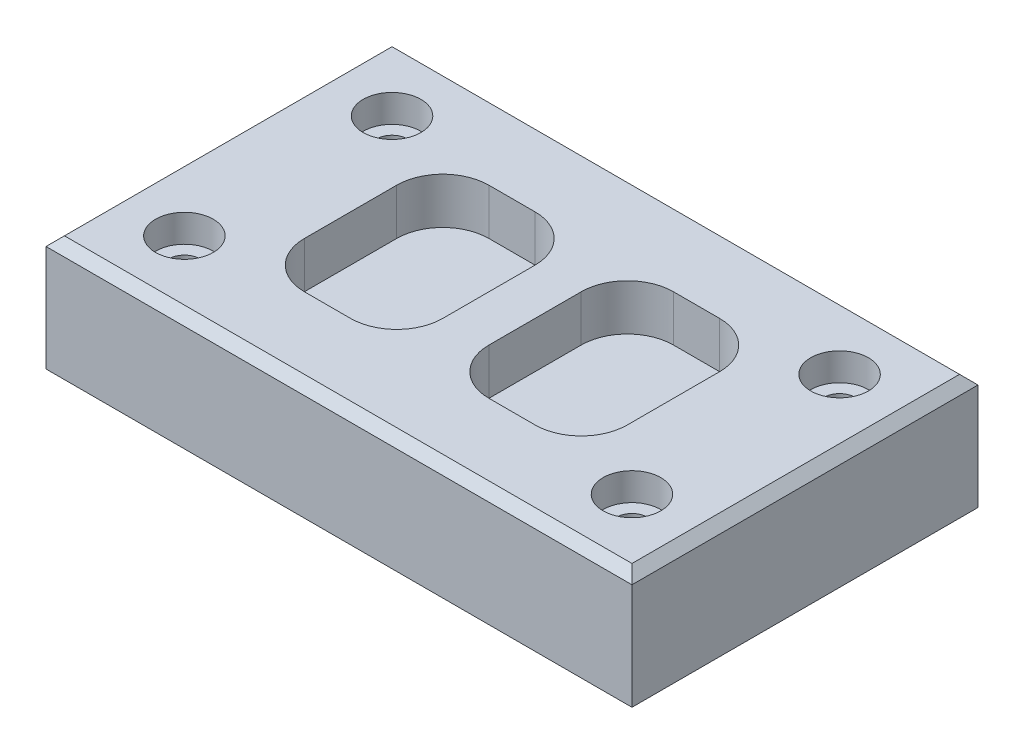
ISO-10303-21;
HEADER;
FILE_DESCRIPTION(('STEP AP214'),'2;1');
FILE_NAME('part.step','',(''),(''),'','','');
FILE_SCHEMA(('AUTOMOTIVE_DESIGN { 1 0 10303 214 1 1 1 1 }'));
ENDSEC;
DATA;
#1=APPLICATION_CONTEXT('core data for automotive mechanical design processes');
#2=APPLICATION_PROTOCOL_DEFINITION('international standard','automotive_design',2000,#1);
#3=PRODUCT_CONTEXT('',#1,'mechanical');
#4=PRODUCT('Part','Part','',(#3));
#5=PRODUCT_RELATED_PRODUCT_CATEGORY('part','',(#4));
#6=PRODUCT_DEFINITION_FORMATION('','',#4);
#7=PRODUCT_DEFINITION_CONTEXT('part definition',#1,'design');
#8=PRODUCT_DEFINITION('design','',#6,#7);
#9=PRODUCT_DEFINITION_SHAPE('','',#8);
#10=(LENGTH_UNIT() NAMED_UNIT(*) SI_UNIT(.MILLI.,.METRE.));
#11=(NAMED_UNIT(*) PLANE_ANGLE_UNIT() SI_UNIT($,.RADIAN.));
#12=(NAMED_UNIT(*) SI_UNIT($,.STERADIAN.) SOLID_ANGLE_UNIT());
#13=UNCERTAINTY_MEASURE_WITH_UNIT(LENGTH_MEASURE(1.E-05),#10,'distance_accuracy_value','');
#14=(GEOMETRIC_REPRESENTATION_CONTEXT(3) GLOBAL_UNCERTAINTY_ASSIGNED_CONTEXT((#13)) GLOBAL_UNIT_ASSIGNED_CONTEXT((#10,
#11,#12)) REPRESENTATION_CONTEXT('',''));
#15=CARTESIAN_POINT('',(0.,0.,0.));
#16=DIRECTION('',(0.,0.,1.));
#17=DIRECTION('',(1.,0.,0.));
#18=AXIS2_PLACEMENT_3D('',#15,#16,#17);
#19=CARTESIAN_POINT('',(-127.,50.,75.));
#20=DIRECTION('',(1.,0.,0.));
#21=DIRECTION('',(0.,0.,-1.));
#22=AXIS2_PLACEMENT_3D('',#19,#20,#21);
#23=PLANE('',#22);
#24=DIRECTION('',(0.,-1.,0.));
#25=VECTOR('',#24,1.);
#26=CARTESIAN_POINT('',(-127.,50.,75.));
#27=LINE('',#26,#25);
#28=CARTESIAN_POINT('',(-127.,46.,75.));
#29=VERTEX_POINT('',#28);
#30=CARTESIAN_POINT('',(-127.,0.,75.));
#31=VERTEX_POINT('',#30);
#32=EDGE_CURVE('E334',#29,#31,#27,.T.);
#33=ORIENTED_EDGE('',*,*,#32,.F.);
#34=DIRECTION('',(0.,0.,-1.));
#35=VECTOR('',#34,1.);
#36=CARTESIAN_POINT('',(-127.,46.,-75.));
#37=LINE('',#36,#35);
#38=CARTESIAN_POINT('',(-127.,46.,-75.));
#39=VERTEX_POINT('',#38);
#40=EDGE_CURVE('E650',#29,#39,#37,.T.);
#41=ORIENTED_EDGE('',*,*,#40,.T.);
#42=DIRECTION('',(0.,-1.,0.));
#43=VECTOR('',#42,1.);
#44=CARTESIAN_POINT('',(-127.,50.,-75.));
#45=LINE('',#44,#43);
#46=CARTESIAN_POINT('',(-127.,0.,-75.));
#47=VERTEX_POINT('',#46);
#48=EDGE_CURVE('E328',#39,#47,#45,.T.);
#49=ORIENTED_EDGE('',*,*,#48,.T.);
#50=DIRECTION('',(0.,0.,1.));
#51=VECTOR('',#50,1.);
#52=CARTESIAN_POINT('',(-127.,0.,75.));
#53=LINE('',#52,#51);
#54=EDGE_CURVE('E292',#47,#31,#53,.T.);
#55=ORIENTED_EDGE('',*,*,#54,.T.);
#56=EDGE_LOOP('',(#33,#41,#49,#55));
#57=FACE_BOUND('',#56,.T.);
#58=ADVANCED_FACE('F40',(#57),#23,.F.);
#59=CARTESIAN_POINT('',(127.,50.,75.));
#60=DIRECTION('',(0.,0.,-1.));
#61=DIRECTION('',(-1.,0.,0.));
#62=AXIS2_PLACEMENT_3D('',#59,#60,#61);
#63=PLANE('',#62);
#64=DIRECTION('',(0.,-1.,0.));
#65=VECTOR('',#64,1.);
#66=CARTESIAN_POINT('',(127.,50.,75.));
#67=LINE('',#66,#65);
#68=CARTESIAN_POINT('',(127.,46.,75.));
#69=VERTEX_POINT('',#68);
#70=CARTESIAN_POINT('',(127.,0.,75.));
#71=VERTEX_POINT('',#70);
#72=EDGE_CURVE('E332',#69,#71,#67,.T.);
#73=ORIENTED_EDGE('',*,*,#72,.F.);
#74=DIRECTION('',(-1.,0.,0.));
#75=VECTOR('',#74,1.);
#76=CARTESIAN_POINT('',(-127.,46.,75.));
#77=LINE('',#76,#75);
#78=EDGE_CURVE('E12',#69,#29,#77,.T.);
#79=ORIENTED_EDGE('',*,*,#78,.T.);
#80=ORIENTED_EDGE('',*,*,#32,.T.);
#81=DIRECTION('',(1.,0.,0.));
#82=VECTOR('',#81,1.);
#83=CARTESIAN_POINT('',(127.,0.,75.));
#84=LINE('',#83,#82);
#85=EDGE_CURVE('E319',#31,#71,#84,.T.);
#86=ORIENTED_EDGE('',*,*,#85,.T.);
#87=EDGE_LOOP('',(#73,#79,#80,#86));
#88=FACE_BOUND('',#87,.T.);
#89=ADVANCED_FACE('F711',(#88),#63,.F.);
#90=CARTESIAN_POINT('',(127.,50.,75.));
#91=DIRECTION('',(-1.,0.,0.));
#92=DIRECTION('',(0.,0.,1.));
#93=AXIS2_PLACEMENT_3D('',#90,#91,#92);
#94=PLANE('',#93);
#95=DIRECTION('',(0.,-1.,0.));
#96=VECTOR('',#95,1.);
#97=CARTESIAN_POINT('',(127.,50.,-75.));
#98=LINE('',#97,#96);
#99=CARTESIAN_POINT('',(127.,46.,-75.));
#100=VERTEX_POINT('',#99);
#101=CARTESIAN_POINT('',(127.,0.,-75.));
#102=VERTEX_POINT('',#101);
#103=EDGE_CURVE('E330',#100,#102,#98,.T.);
#104=ORIENTED_EDGE('',*,*,#103,.F.);
#105=DIRECTION('',(0.,0.,1.));
#106=VECTOR('',#105,1.);
#107=CARTESIAN_POINT('',(127.,46.,75.));
#108=LINE('',#107,#106);
#109=EDGE_CURVE('E49',#100,#69,#108,.T.);
#110=ORIENTED_EDGE('',*,*,#109,.T.);
#111=ORIENTED_EDGE('',*,*,#72,.T.);
#112=DIRECTION('',(0.,0.,-1.));
#113=VECTOR('',#112,1.);
#114=CARTESIAN_POINT('',(127.,0.,75.));
#115=LINE('',#114,#113);
#116=EDGE_CURVE('E322',#71,#102,#115,.T.);
#117=ORIENTED_EDGE('',*,*,#116,.T.);
#118=EDGE_LOOP('',(#104,#110,#111,#117));
#119=FACE_BOUND('',#118,.T.);
#120=ADVANCED_FACE('F717',(#119),#94,.F.);
#121=CARTESIAN_POINT('',(127.,50.,-75.));
#122=DIRECTION('',(0.,0.,1.));
#123=DIRECTION('',(1.,0.,0.));
#124=AXIS2_PLACEMENT_3D('',#121,#122,#123);
#125=PLANE('',#124);
#126=ORIENTED_EDGE('',*,*,#48,.F.);
#127=DIRECTION('',(1.,0.,0.));
#128=VECTOR('',#127,1.);
#129=CARTESIAN_POINT('',(127.,46.,-75.));
#130=LINE('',#129,#128);
#131=EDGE_CURVE('E652',#39,#100,#130,.T.);
#132=ORIENTED_EDGE('',*,*,#131,.T.);
#133=ORIENTED_EDGE('',*,*,#103,.T.);
#134=DIRECTION('',(-1.,0.,0.));
#135=VECTOR('',#134,1.);
#136=CARTESIAN_POINT('',(127.,0.,-75.));
#137=LINE('',#136,#135);
#138=EDGE_CURVE('E325',#102,#47,#137,.T.);
#139=ORIENTED_EDGE('',*,*,#138,.T.);
#140=EDGE_LOOP('',(#126,#132,#133,#139));
#141=FACE_BOUND('',#140,.T.);
#142=ADVANCED_FACE('F477',(#141),#125,.F.);
#143=CARTESIAN_POINT('',(0.,50.,0.));
#144=DIRECTION('',(0.,1.,0.));
#145=DIRECTION('',(0.,0.,1.));
#146=AXIS2_PLACEMENT_3D('',#143,#144,#145);
#147=PLANE('',#146);
#148=DIRECTION('',(0.,0.,-1.));
#149=VECTOR('',#148,1.);
#150=CARTESIAN_POINT('',(123.,50.,-75.));
#151=LINE('',#150,#149);
#152=CARTESIAN_POINT('',(123.,50.,70.9999999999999));
#153=VERTEX_POINT('',#152);
#154=CARTESIAN_POINT('',(123.,50.,-71.));
#155=VERTEX_POINT('',#154);
#156=EDGE_CURVE('E340',#153,#155,#151,.T.);
#157=ORIENTED_EDGE('',*,*,#156,.T.);
#158=DIRECTION('',(-1.,0.,0.));
#159=VECTOR('',#158,1.);
#160=CARTESIAN_POINT('',(-127.,50.,-71.));
#161=LINE('',#160,#159);
#162=CARTESIAN_POINT('',(-123.,50.,-71.));
#163=VERTEX_POINT('',#162);
#164=EDGE_CURVE('E655',#155,#163,#161,.T.);
#165=ORIENTED_EDGE('',*,*,#164,.T.);
#166=DIRECTION('',(0.,0.,1.));
#167=VECTOR('',#166,1.);
#168=CARTESIAN_POINT('',(-123.,50.,75.));
#169=LINE('',#168,#167);
#170=CARTESIAN_POINT('',(-123.,50.,71.));
#171=VERTEX_POINT('',#170);
#172=EDGE_CURVE('E657',#163,#171,#169,.T.);
#173=ORIENTED_EDGE('',*,*,#172,.T.);
#174=DIRECTION('',(1.,0.,0.));
#175=VECTOR('',#174,1.);
#176=CARTESIAN_POINT('',(127.,50.,70.9999999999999));
#177=LINE('',#176,#175);
#178=EDGE_CURVE('E336',#171,#153,#177,.T.);
#179=ORIENTED_EDGE('',*,*,#178,.T.);
#180=EDGE_LOOP('',(#157,#165,#173,#179));
#181=FACE_BOUND('',#180,.T.);
#182=CARTESIAN_POINT('',(-97.,50.,45.));
#183=DIRECTION('',(0.,1.,0.));
#184=DIRECTION('',(0.,0.,1.));
#185=AXIS2_PLACEMENT_3D('',#182,#183,#184);
#186=CIRCLE('',#185,12.5);
#187=CARTESIAN_POINT('',(-97.,50.,57.5));
#188=VERTEX_POINT('',#187);
#189=EDGE_CURVE('E573',#188,#188,#186,.T.);
#190=ORIENTED_EDGE('',*,*,#189,.F.);
#191=EDGE_LOOP('',(#190));
#192=FACE_BOUND('',#191,.T.);
#193=CARTESIAN_POINT('',(-97.,50.,-45.));
#194=DIRECTION('',(0.,1.,0.));
#195=DIRECTION('',(0.,0.,1.));
#196=AXIS2_PLACEMENT_3D('',#193,#194,#195);
#197=CIRCLE('',#196,12.5);
#198=CARTESIAN_POINT('',(-97.,50.,-32.5));
#199=VERTEX_POINT('',#198);
#200=EDGE_CURVE('E554',#199,#199,#197,.T.);
#201=ORIENTED_EDGE('',*,*,#200,.F.);
#202=EDGE_LOOP('',(#201));
#203=FACE_BOUND('',#202,.T.);
#204=CARTESIAN_POINT('',(97.,50.,-45.));
#205=DIRECTION('',(0.,1.,0.));
#206=DIRECTION('',(0.,0.,1.));
#207=AXIS2_PLACEMENT_3D('',#204,#205,#206);
#208=CIRCLE('',#207,12.5);
#209=CARTESIAN_POINT('',(97.,50.,-32.5));
#210=VERTEX_POINT('',#209);
#211=EDGE_CURVE('E581',#210,#210,#208,.T.);
#212=ORIENTED_EDGE('',*,*,#211,.F.);
#213=EDGE_LOOP('',(#212));
#214=FACE_BOUND('',#213,.T.);
#215=CARTESIAN_POINT('',(97.,50.,45.));
#216=DIRECTION('',(0.,1.,0.));
#217=DIRECTION('',(0.,0.,1.));
#218=AXIS2_PLACEMENT_3D('',#215,#216,#217);
#219=CIRCLE('',#218,12.5);
#220=CARTESIAN_POINT('',(97.,50.,57.5));
#221=VERTEX_POINT('',#220);
#222=EDGE_CURVE('E448',#221,#221,#219,.T.);
#223=ORIENTED_EDGE('',*,*,#222,.F.);
#224=EDGE_LOOP('',(#223));
#225=FACE_BOUND('',#224,.T.);
#226=CARTESIAN_POINT('',(-50.,50.,-20.));
#227=DIRECTION('',(0.,1.,0.));
#228=DIRECTION('',(0.,0.,-1.));
#229=AXIS2_PLACEMENT_3D('',#226,#227,#228);
#230=CIRCLE('',#229,20.);
#231=CARTESIAN_POINT('',(-50.,50.,-40.));
#232=VERTEX_POINT('',#231);
#233=CARTESIAN_POINT('',(-70.,50.,-20.));
#234=VERTEX_POINT('',#233);
#235=EDGE_CURVE('E196',#232,#234,#230,.T.);
#236=ORIENTED_EDGE('',*,*,#235,.F.);
#237=DIRECTION('',(-1.,0.,0.));
#238=VECTOR('',#237,1.);
#239=CARTESIAN_POINT('',(-50.,50.,-40.));
#240=LINE('',#239,#238);
#241=CARTESIAN_POINT('',(-30.,50.,-40.));
#242=VERTEX_POINT('',#241);
#243=EDGE_CURVE('E214',#242,#232,#240,.T.);
#244=ORIENTED_EDGE('',*,*,#243,.F.);
#245=CARTESIAN_POINT('',(-30.,50.,-20.));
#246=DIRECTION('',(0.,1.,0.));
#247=DIRECTION('',(0.,0.,-1.));
#248=AXIS2_PLACEMENT_3D('',#245,#246,#247);
#249=CIRCLE('',#248,20.);
#250=CARTESIAN_POINT('',(-9.99999999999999,50.,-20.));
#251=VERTEX_POINT('',#250);
#252=EDGE_CURVE('E217',#251,#242,#249,.T.);
#253=ORIENTED_EDGE('',*,*,#252,.F.);
#254=DIRECTION('',(0.,0.,-1.));
#255=VECTOR('',#254,1.);
#256=CARTESIAN_POINT('',(-9.99999999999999,50.,-20.));
#257=LINE('',#256,#255);
#258=CARTESIAN_POINT('',(-9.99999999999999,50.,20.));
#259=VERTEX_POINT('',#258);
#260=EDGE_CURVE('E281',#259,#251,#257,.T.);
#261=ORIENTED_EDGE('',*,*,#260,.F.);
#262=CARTESIAN_POINT('',(-30.,50.,20.));
#263=DIRECTION('',(0.,1.,0.));
#264=DIRECTION('',(0.,0.,-1.));
#265=AXIS2_PLACEMENT_3D('',#262,#263,#264);
#266=CIRCLE('',#265,20.);
#267=CARTESIAN_POINT('',(-30.,50.,40.));
#268=VERTEX_POINT('',#267);
#269=EDGE_CURVE('E277',#268,#259,#266,.T.);
#270=ORIENTED_EDGE('',*,*,#269,.F.);
#271=DIRECTION('',(1.,0.,0.));
#272=VECTOR('',#271,1.);
#273=CARTESIAN_POINT('',(-30.,50.,40.));
#274=LINE('',#273,#272);
#275=CARTESIAN_POINT('',(-50.,50.,40.));
#276=VERTEX_POINT('',#275);
#277=EDGE_CURVE('E273',#276,#268,#274,.T.);
#278=ORIENTED_EDGE('',*,*,#277,.F.);
#279=CARTESIAN_POINT('',(-50.,50.,20.));
#280=DIRECTION('',(0.,1.,0.));
#281=DIRECTION('',(0.,0.,1.));
#282=AXIS2_PLACEMENT_3D('',#279,#280,#281);
#283=CIRCLE('',#282,20.);
#284=CARTESIAN_POINT('',(-70.,50.,20.));
#285=VERTEX_POINT('',#284);
#286=EDGE_CURVE('E270',#285,#276,#283,.T.);
#287=ORIENTED_EDGE('',*,*,#286,.F.);
#288=DIRECTION('',(0.,0.,1.));
#289=VECTOR('',#288,1.);
#290=CARTESIAN_POINT('',(-70.,50.,20.));
#291=LINE('',#290,#289);
#292=EDGE_CURVE('E257',#234,#285,#291,.T.);
#293=ORIENTED_EDGE('',*,*,#292,.F.);
#294=EDGE_LOOP('',(#236,#244,#253,#261,#270,#278,#287,#293));
#295=FACE_BOUND('',#294,.T.);
#296=CARTESIAN_POINT('',(30.,50.,-20.));
#297=DIRECTION('',(0.,1.,0.));
#298=DIRECTION('',(0.,0.,1.));
#299=AXIS2_PLACEMENT_3D('',#296,#297,#298);
#300=CIRCLE('',#299,20.);
#301=CARTESIAN_POINT('',(30.,50.,-40.));
#302=VERTEX_POINT('',#301);
#303=CARTESIAN_POINT('',(10.,50.,-20.));
#304=VERTEX_POINT('',#303);
#305=EDGE_CURVE('E485',#302,#304,#300,.T.);
#306=ORIENTED_EDGE('',*,*,#305,.F.);
#307=DIRECTION('',(-1.,0.,0.));
#308=VECTOR('',#307,1.);
#309=CARTESIAN_POINT('',(50.,50.,-40.));
#310=LINE('',#309,#308);
#311=CARTESIAN_POINT('',(50.,50.,-40.));
#312=VERTEX_POINT('',#311);
#313=EDGE_CURVE('E488',#312,#302,#310,.T.);
#314=ORIENTED_EDGE('',*,*,#313,.F.);
#315=CARTESIAN_POINT('',(50.,50.,-20.));
#316=DIRECTION('',(0.,1.,0.));
#317=DIRECTION('',(0.,0.,1.));
#318=AXIS2_PLACEMENT_3D('',#315,#316,#317);
#319=CIRCLE('',#318,20.);
#320=CARTESIAN_POINT('',(70.,50.,-20.));
#321=VERTEX_POINT('',#320);
#322=EDGE_CURVE('E528',#321,#312,#319,.T.);
#323=ORIENTED_EDGE('',*,*,#322,.F.);
#324=DIRECTION('',(0.,0.,-1.));
#325=VECTOR('',#324,1.);
#326=CARTESIAN_POINT('',(70.,50.,20.));
#327=LINE('',#326,#325);
#328=CARTESIAN_POINT('',(70.,50.,20.));
#329=VERTEX_POINT('',#328);
#330=EDGE_CURVE('E520',#329,#321,#327,.T.);
#331=ORIENTED_EDGE('',*,*,#330,.F.);
#332=CARTESIAN_POINT('',(50.,50.,20.));
#333=DIRECTION('',(0.,1.,0.));
#334=DIRECTION('',(0.,0.,-1.));
#335=AXIS2_PLACEMENT_3D('',#332,#333,#334);
#336=CIRCLE('',#335,20.);
#337=CARTESIAN_POINT('',(50.,50.,40.));
#338=VERTEX_POINT('',#337);
#339=EDGE_CURVE('E516',#338,#329,#336,.T.);
#340=ORIENTED_EDGE('',*,*,#339,.F.);
#341=DIRECTION('',(1.,0.,0.));
#342=VECTOR('',#341,1.);
#343=CARTESIAN_POINT('',(30.,50.,40.));
#344=LINE('',#343,#342);
#345=CARTESIAN_POINT('',(30.,50.,40.));
#346=VERTEX_POINT('',#345);
#347=EDGE_CURVE('E512',#346,#338,#344,.T.);
#348=ORIENTED_EDGE('',*,*,#347,.F.);
#349=CARTESIAN_POINT('',(30.,50.,20.));
#350=DIRECTION('',(0.,1.,0.));
#351=DIRECTION('',(0.,0.,1.));
#352=AXIS2_PLACEMENT_3D('',#349,#350,#351);
#353=CIRCLE('',#352,20.);
#354=CARTESIAN_POINT('',(10.,50.,20.));
#355=VERTEX_POINT('',#354);
#356=EDGE_CURVE('E494',#355,#346,#353,.T.);
#357=ORIENTED_EDGE('',*,*,#356,.F.);
#358=DIRECTION('',(0.,0.,1.));
#359=VECTOR('',#358,1.);
#360=CARTESIAN_POINT('',(10.,50.,-20.));
#361=LINE('',#360,#359);
#362=EDGE_CURVE('E491',#304,#355,#361,.T.);
#363=ORIENTED_EDGE('',*,*,#362,.F.);
#364=EDGE_LOOP('',(#306,#314,#323,#331,#340,#348,#357,#363));
#365=FACE_BOUND('',#364,.T.);
#366=ADVANCED_FACE('F473',(#181,#192,#203,#214,#225,#295,#365),#147,.T.);
#367=CARTESIAN_POINT('',(0.,0.,0.));
#368=DIRECTION('',(0.,1.,0.));
#369=DIRECTION('',(0.,0.,1.));
#370=AXIS2_PLACEMENT_3D('',#367,#368,#369);
#371=PLANE('',#370);
#372=CARTESIAN_POINT('',(-97.,0.,45.));
#373=DIRECTION('',(0.,1.,0.));
#374=DIRECTION('',(0.,0.,1.));
#375=AXIS2_PLACEMENT_3D('',#372,#373,#374);
#376=CIRCLE('',#375,6.74999999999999);
#377=CARTESIAN_POINT('',(-97.,0.,51.75));
#378=VERTEX_POINT('',#377);
#379=EDGE_CURVE('E577',#378,#378,#376,.T.);
#380=ORIENTED_EDGE('',*,*,#379,.T.);
#381=EDGE_LOOP('',(#380));
#382=FACE_BOUND('',#381,.T.);
#383=CARTESIAN_POINT('',(-97.,0.,-45.));
#384=DIRECTION('',(0.,1.,0.));
#385=DIRECTION('',(0.,0.,1.));
#386=AXIS2_PLACEMENT_3D('',#383,#384,#385);
#387=CIRCLE('',#386,6.74999999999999);
#388=CARTESIAN_POINT('',(-97.,0.,-38.25));
#389=VERTEX_POINT('',#388);
#390=EDGE_CURVE('E560',#389,#389,#387,.T.);
#391=ORIENTED_EDGE('',*,*,#390,.T.);
#392=EDGE_LOOP('',(#391));
#393=FACE_BOUND('',#392,.T.);
#394=CARTESIAN_POINT('',(97.,0.,-45.));
#395=DIRECTION('',(0.,1.,0.));
#396=DIRECTION('',(0.,0.,1.));
#397=AXIS2_PLACEMENT_3D('',#394,#395,#396);
#398=CIRCLE('',#397,6.74999999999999);
#399=CARTESIAN_POINT('',(97.,0.,-38.25));
#400=VERTEX_POINT('',#399);
#401=EDGE_CURVE('E460',#400,#400,#398,.T.);
#402=ORIENTED_EDGE('',*,*,#401,.T.);
#403=EDGE_LOOP('',(#402));
#404=FACE_BOUND('',#403,.T.);
#405=CARTESIAN_POINT('',(97.,0.,45.));
#406=DIRECTION('',(0.,1.,0.));
#407=DIRECTION('',(0.,0.,1.));
#408=AXIS2_PLACEMENT_3D('',#405,#406,#407);
#409=CIRCLE('',#408,6.74999999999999);
#410=CARTESIAN_POINT('',(97.,0.,51.75));
#411=VERTEX_POINT('',#410);
#412=EDGE_CURVE('E221',#411,#411,#409,.T.);
#413=ORIENTED_EDGE('',*,*,#412,.T.);
#414=EDGE_LOOP('',(#413));
#415=FACE_BOUND('',#414,.T.);
#416=ORIENTED_EDGE('',*,*,#54,.F.);
#417=ORIENTED_EDGE('',*,*,#138,.F.);
#418=ORIENTED_EDGE('',*,*,#116,.F.);
#419=ORIENTED_EDGE('',*,*,#85,.F.);
#420=EDGE_LOOP('',(#416,#417,#418,#419));
#421=FACE_BOUND('',#420,.T.);
#422=ADVANCED_FACE('F476',(#382,#393,#404,#415,#421),#371,.F.);
#423=CARTESIAN_POINT('',(30.,30.,-20.));
#424=DIRECTION('',(0.,1.,0.));
#425=DIRECTION('',(0.,0.,1.));
#426=AXIS2_PLACEMENT_3D('',#423,#424,#425);
#427=CYLINDRICAL_SURFACE('',#426,20.);
#428=ORIENTED_EDGE('',*,*,#305,.T.);
#429=DIRECTION('',(0.,1.,0.));
#430=VECTOR('',#429,1.);
#431=CARTESIAN_POINT('',(10.,30.,-20.));
#432=LINE('',#431,#430);
#433=CARTESIAN_POINT('',(10.,30.,-20.));
#434=VERTEX_POINT('',#433);
#435=EDGE_CURVE('E310',#434,#304,#432,.T.);
#436=ORIENTED_EDGE('',*,*,#435,.F.);
#437=CARTESIAN_POINT('',(30.,30.,-20.));
#438=DIRECTION('',(0.,1.,0.));
#439=DIRECTION('',(0.,0.,1.));
#440=AXIS2_PLACEMENT_3D('',#437,#438,#439);
#441=CIRCLE('',#440,20.);
#442=CARTESIAN_POINT('',(30.,30.,-40.));
#443=VERTEX_POINT('',#442);
#444=EDGE_CURVE('E533',#443,#434,#441,.T.);
#445=ORIENTED_EDGE('',*,*,#444,.F.);
#446=DIRECTION('',(0.,1.,0.));
#447=VECTOR('',#446,1.);
#448=CARTESIAN_POINT('',(30.,30.,-40.));
#449=LINE('',#448,#447);
#450=EDGE_CURVE('E258',#443,#302,#449,.T.);
#451=ORIENTED_EDGE('',*,*,#450,.T.);
#452=EDGE_LOOP('',(#428,#436,#445,#451));
#453=FACE_BOUND('',#452,.T.);
#454=ADVANCED_FACE('F726',(#453),#427,.F.);
#455=CARTESIAN_POINT('',(50.,30.,-40.));
#456=DIRECTION('',(0.,0.,-1.));
#457=DIRECTION('',(-1.,0.,0.));
#458=AXIS2_PLACEMENT_3D('',#455,#456,#457);
#459=PLANE('',#458);
#460=ORIENTED_EDGE('',*,*,#313,.T.);
#461=ORIENTED_EDGE('',*,*,#450,.F.);
#462=DIRECTION('',(-1.,0.,0.));
#463=VECTOR('',#462,1.);
#464=CARTESIAN_POINT('',(50.,30.,-40.));
#465=LINE('',#464,#463);
#466=CARTESIAN_POINT('',(50.,30.,-40.));
#467=VERTEX_POINT('',#466);
#468=EDGE_CURVE('E316',#467,#443,#465,.T.);
#469=ORIENTED_EDGE('',*,*,#468,.F.);
#470=DIRECTION('',(0.,1.,0.));
#471=VECTOR('',#470,1.);
#472=CARTESIAN_POINT('',(50.,30.,-40.));
#473=LINE('',#472,#471);
#474=EDGE_CURVE('E536',#467,#312,#473,.T.);
#475=ORIENTED_EDGE('',*,*,#474,.T.);
#476=EDGE_LOOP('',(#460,#461,#469,#475));
#477=FACE_BOUND('',#476,.T.);
#478=ADVANCED_FACE('F730',(#477),#459,.F.);
#479=CARTESIAN_POINT('',(50.,30.,-20.));
#480=DIRECTION('',(0.,1.,0.));
#481=DIRECTION('',(0.,0.,1.));
#482=AXIS2_PLACEMENT_3D('',#479,#480,#481);
#483=CYLINDRICAL_SURFACE('',#482,20.);
#484=ORIENTED_EDGE('',*,*,#322,.T.);
#485=ORIENTED_EDGE('',*,*,#474,.F.);
#486=CARTESIAN_POINT('',(50.,30.,-20.));
#487=DIRECTION('',(0.,1.,0.));
#488=DIRECTION('',(0.,0.,1.));
#489=AXIS2_PLACEMENT_3D('',#486,#487,#488);
#490=CIRCLE('',#489,20.);
#491=CARTESIAN_POINT('',(70.,30.,-20.));
#492=VERTEX_POINT('',#491);
#493=EDGE_CURVE('E1183',#492,#467,#490,.T.);
#494=ORIENTED_EDGE('',*,*,#493,.F.);
#495=DIRECTION('',(0.,1.,0.));
#496=VECTOR('',#495,1.);
#497=CARTESIAN_POINT('',(70.,30.,-20.));
#498=LINE('',#497,#496);
#499=EDGE_CURVE('E1194',#492,#321,#498,.T.);
#500=ORIENTED_EDGE('',*,*,#499,.T.);
#501=EDGE_LOOP('',(#484,#485,#494,#500));
#502=FACE_BOUND('',#501,.T.);
#503=ADVANCED_FACE('F751',(#502),#483,.F.);
#504=CARTESIAN_POINT('',(70.,30.,20.));
#505=DIRECTION('',(1.,0.,0.));
#506=DIRECTION('',(0.,0.,-1.));
#507=AXIS2_PLACEMENT_3D('',#504,#505,#506);
#508=PLANE('',#507);
#509=ORIENTED_EDGE('',*,*,#330,.T.);
#510=ORIENTED_EDGE('',*,*,#499,.F.);
#511=DIRECTION('',(0.,0.,-1.));
#512=VECTOR('',#511,1.);
#513=CARTESIAN_POINT('',(70.,30.,20.));
#514=LINE('',#513,#512);
#515=CARTESIAN_POINT('',(70.,30.,20.));
#516=VERTEX_POINT('',#515);
#517=EDGE_CURVE('E1180',#516,#492,#514,.T.);
#518=ORIENTED_EDGE('',*,*,#517,.F.);
#519=DIRECTION('',(0.,1.,0.));
#520=VECTOR('',#519,1.);
#521=CARTESIAN_POINT('',(70.,30.,20.));
#522=LINE('',#521,#520);
#523=EDGE_CURVE('E1193',#516,#329,#522,.T.);
#524=ORIENTED_EDGE('',*,*,#523,.T.);
#525=EDGE_LOOP('',(#509,#510,#518,#524));
#526=FACE_BOUND('',#525,.T.);
#527=ADVANCED_FACE('F747',(#526),#508,.F.);
#528=CARTESIAN_POINT('',(50.,30.,20.));
#529=DIRECTION('',(0.,1.,0.));
#530=DIRECTION('',(0.,0.,1.));
#531=AXIS2_PLACEMENT_3D('',#528,#529,#530);
#532=CYLINDRICAL_SURFACE('',#531,20.);
#533=ORIENTED_EDGE('',*,*,#339,.T.);
#534=ORIENTED_EDGE('',*,*,#523,.F.);
#535=CARTESIAN_POINT('',(50.,30.,20.));
#536=DIRECTION('',(0.,1.,0.));
#537=DIRECTION('',(0.,0.,-1.));
#538=AXIS2_PLACEMENT_3D('',#535,#536,#537);
#539=CIRCLE('',#538,20.);
#540=CARTESIAN_POINT('',(50.,30.,40.));
#541=VERTEX_POINT('',#540);
#542=EDGE_CURVE('E1176',#541,#516,#539,.T.);
#543=ORIENTED_EDGE('',*,*,#542,.F.);
#544=DIRECTION('',(0.,1.,0.));
#545=VECTOR('',#544,1.);
#546=CARTESIAN_POINT('',(50.,30.,40.));
#547=LINE('',#546,#545);
#548=EDGE_CURVE('E1201',#541,#338,#547,.T.);
#549=ORIENTED_EDGE('',*,*,#548,.T.);
#550=EDGE_LOOP('',(#533,#534,#543,#549));
#551=FACE_BOUND('',#550,.T.);
#552=ADVANCED_FACE('F743',(#551),#532,.F.);
#553=CARTESIAN_POINT('',(30.,30.,40.));
#554=DIRECTION('',(0.,0.,1.));
#555=DIRECTION('',(1.,0.,0.));
#556=AXIS2_PLACEMENT_3D('',#553,#554,#555);
#557=PLANE('',#556);
#558=ORIENTED_EDGE('',*,*,#347,.T.);
#559=ORIENTED_EDGE('',*,*,#548,.F.);
#560=DIRECTION('',(1.,0.,0.));
#561=VECTOR('',#560,1.);
#562=CARTESIAN_POINT('',(30.,30.,40.));
#563=LINE('',#562,#561);
#564=CARTESIAN_POINT('',(30.,30.,40.));
#565=VERTEX_POINT('',#564);
#566=EDGE_CURVE('E1172',#565,#541,#563,.T.);
#567=ORIENTED_EDGE('',*,*,#566,.F.);
#568=DIRECTION('',(0.,1.,0.));
#569=VECTOR('',#568,1.);
#570=CARTESIAN_POINT('',(30.,30.,40.));
#571=LINE('',#570,#569);
#572=EDGE_CURVE('E309',#565,#346,#571,.T.);
#573=ORIENTED_EDGE('',*,*,#572,.T.);
#574=EDGE_LOOP('',(#558,#559,#567,#573));
#575=FACE_BOUND('',#574,.T.);
#576=ADVANCED_FACE('F739',(#575),#557,.F.);
#577=CARTESIAN_POINT('',(30.,30.,20.));
#578=DIRECTION('',(0.,1.,0.));
#579=DIRECTION('',(0.,0.,1.));
#580=AXIS2_PLACEMENT_3D('',#577,#578,#579);
#581=CYLINDRICAL_SURFACE('',#580,20.);
#582=ORIENTED_EDGE('',*,*,#356,.T.);
#583=ORIENTED_EDGE('',*,*,#572,.F.);
#584=CARTESIAN_POINT('',(30.,30.,20.));
#585=DIRECTION('',(0.,1.,0.));
#586=DIRECTION('',(0.,0.,1.));
#587=AXIS2_PLACEMENT_3D('',#584,#585,#586);
#588=CIRCLE('',#587,20.);
#589=CARTESIAN_POINT('',(10.,30.,20.));
#590=VERTEX_POINT('',#589);
#591=EDGE_CURVE('E1169',#590,#565,#588,.T.);
#592=ORIENTED_EDGE('',*,*,#591,.F.);
#593=DIRECTION('',(0.,1.,0.));
#594=VECTOR('',#593,1.);
#595=CARTESIAN_POINT('',(10.,30.,20.));
#596=LINE('',#595,#594);
#597=EDGE_CURVE('E306',#590,#355,#596,.T.);
#598=ORIENTED_EDGE('',*,*,#597,.T.);
#599=EDGE_LOOP('',(#582,#583,#592,#598));
#600=FACE_BOUND('',#599,.T.);
#601=ADVANCED_FACE('F735',(#600),#581,.F.);
#602=CARTESIAN_POINT('',(10.,30.,-20.));
#603=DIRECTION('',(-1.,0.,0.));
#604=DIRECTION('',(0.,0.,1.));
#605=AXIS2_PLACEMENT_3D('',#602,#603,#604);
#606=PLANE('',#605);
#607=ORIENTED_EDGE('',*,*,#362,.T.);
#608=ORIENTED_EDGE('',*,*,#597,.F.);
#609=DIRECTION('',(0.,0.,1.));
#610=VECTOR('',#609,1.);
#611=CARTESIAN_POINT('',(10.,30.,-20.));
#612=LINE('',#611,#610);
#613=EDGE_CURVE('E1161',#434,#590,#612,.T.);
#614=ORIENTED_EDGE('',*,*,#613,.F.);
#615=ORIENTED_EDGE('',*,*,#435,.T.);
#616=EDGE_LOOP('',(#607,#608,#614,#615));
#617=FACE_BOUND('',#616,.T.);
#618=ADVANCED_FACE('F731',(#617),#606,.F.);
#619=CARTESIAN_POINT('',(30.,30.,-20.));
#620=DIRECTION('',(0.,1.,0.));
#621=DIRECTION('',(0.,0.,1.));
#622=AXIS2_PLACEMENT_3D('',#619,#620,#621);
#623=PLANE('',#622);
#624=ORIENTED_EDGE('',*,*,#444,.T.);
#625=ORIENTED_EDGE('',*,*,#613,.T.);
#626=ORIENTED_EDGE('',*,*,#591,.T.);
#627=ORIENTED_EDGE('',*,*,#566,.T.);
#628=ORIENTED_EDGE('',*,*,#542,.T.);
#629=ORIENTED_EDGE('',*,*,#517,.T.);
#630=ORIENTED_EDGE('',*,*,#493,.T.);
#631=ORIENTED_EDGE('',*,*,#468,.T.);
#632=EDGE_LOOP('',(#624,#625,#626,#627,#628,#629,#630,#631));
#633=FACE_BOUND('',#632,.T.);
#634=ADVANCED_FACE('F734',(#633),#623,.T.);
#635=CARTESIAN_POINT('',(-50.,30.,-20.));
#636=DIRECTION('',(0.,1.,0.));
#637=DIRECTION('',(0.,0.,1.));
#638=AXIS2_PLACEMENT_3D('',#635,#636,#637);
#639=CYLINDRICAL_SURFACE('',#638,20.);
#640=ORIENTED_EDGE('',*,*,#235,.T.);
#641=DIRECTION('',(0.,1.,0.));
#642=VECTOR('',#641,1.);
#643=CARTESIAN_POINT('',(-70.,30.,-20.));
#644=LINE('',#643,#642);
#645=CARTESIAN_POINT('',(-70.,30.,-20.));
#646=VERTEX_POINT('',#645);
#647=EDGE_CURVE('E189',#646,#234,#644,.T.);
#648=ORIENTED_EDGE('',*,*,#647,.F.);
#649=CARTESIAN_POINT('',(-50.,30.,-20.));
#650=DIRECTION('',(0.,1.,0.));
#651=DIRECTION('',(0.,0.,-1.));
#652=AXIS2_PLACEMENT_3D('',#649,#650,#651);
#653=CIRCLE('',#652,20.);
#654=CARTESIAN_POINT('',(-50.,30.,-40.));
#655=VERTEX_POINT('',#654);
#656=EDGE_CURVE('E193',#655,#646,#653,.T.);
#657=ORIENTED_EDGE('',*,*,#656,.F.);
#658=DIRECTION('',(0.,1.,0.));
#659=VECTOR('',#658,1.);
#660=CARTESIAN_POINT('',(-50.,30.,-40.));
#661=LINE('',#660,#659);
#662=EDGE_CURVE('E289',#655,#232,#661,.T.);
#663=ORIENTED_EDGE('',*,*,#662,.T.);
#664=EDGE_LOOP('',(#640,#648,#657,#663));
#665=FACE_BOUND('',#664,.T.);
#666=ADVANCED_FACE('F191',(#665),#639,.F.);
#667=CARTESIAN_POINT('',(-50.,30.,-40.));
#668=DIRECTION('',(0.,0.,-1.));
#669=DIRECTION('',(-1.,0.,0.));
#670=AXIS2_PLACEMENT_3D('',#667,#668,#669);
#671=PLANE('',#670);
#672=ORIENTED_EDGE('',*,*,#243,.T.);
#673=ORIENTED_EDGE('',*,*,#662,.F.);
#674=DIRECTION('',(-1.,0.,0.));
#675=VECTOR('',#674,1.);
#676=CARTESIAN_POINT('',(-50.,30.,-40.));
#677=LINE('',#676,#675);
#678=CARTESIAN_POINT('',(-30.,30.,-40.));
#679=VERTEX_POINT('',#678);
#680=EDGE_CURVE('E201',#679,#655,#677,.T.);
#681=ORIENTED_EDGE('',*,*,#680,.F.);
#682=DIRECTION('',(0.,1.,0.));
#683=VECTOR('',#682,1.);
#684=CARTESIAN_POINT('',(-30.,30.,-40.));
#685=LINE('',#684,#683);
#686=EDGE_CURVE('E293',#679,#242,#685,.T.);
#687=ORIENTED_EDGE('',*,*,#686,.T.);
#688=EDGE_LOOP('',(#672,#673,#681,#687));
#689=FACE_BOUND('',#688,.T.);
#690=ADVANCED_FACE('F764',(#689),#671,.F.);
#691=CARTESIAN_POINT('',(-30.,30.,-20.));
#692=DIRECTION('',(0.,1.,0.));
#693=DIRECTION('',(0.,0.,1.));
#694=AXIS2_PLACEMENT_3D('',#691,#692,#693);
#695=CYLINDRICAL_SURFACE('',#694,20.);
#696=ORIENTED_EDGE('',*,*,#252,.T.);
#697=ORIENTED_EDGE('',*,*,#686,.F.);
#698=CARTESIAN_POINT('',(-30.,30.,-20.));
#699=DIRECTION('',(0.,1.,0.));
#700=DIRECTION('',(0.,0.,-1.));
#701=AXIS2_PLACEMENT_3D('',#698,#699,#700);
#702=CIRCLE('',#701,20.);
#703=CARTESIAN_POINT('',(-9.99999999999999,30.,-20.));
#704=VERTEX_POINT('',#703);
#705=EDGE_CURVE('E251',#704,#679,#702,.T.);
#706=ORIENTED_EDGE('',*,*,#705,.F.);
#707=DIRECTION('',(0.,1.,0.));
#708=VECTOR('',#707,1.);
#709=CARTESIAN_POINT('',(-9.99999999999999,30.,-20.));
#710=LINE('',#709,#708);
#711=EDGE_CURVE('E1135',#704,#251,#710,.T.);
#712=ORIENTED_EDGE('',*,*,#711,.T.);
#713=EDGE_LOOP('',(#696,#697,#706,#712));
#714=FACE_BOUND('',#713,.T.);
#715=ADVANCED_FACE('F782',(#714),#695,.F.);
#716=CARTESIAN_POINT('',(-9.99999999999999,30.,-20.));
#717=DIRECTION('',(1.,0.,0.));
#718=DIRECTION('',(0.,0.,-1.));
#719=AXIS2_PLACEMENT_3D('',#716,#717,#718);
#720=PLANE('',#719);
#721=ORIENTED_EDGE('',*,*,#260,.T.);
#722=ORIENTED_EDGE('',*,*,#711,.F.);
#723=DIRECTION('',(0.,0.,-1.));
#724=VECTOR('',#723,1.);
#725=CARTESIAN_POINT('',(-9.99999999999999,30.,-20.));
#726=LINE('',#725,#724);
#727=CARTESIAN_POINT('',(-9.99999999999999,30.,20.));
#728=VERTEX_POINT('',#727);
#729=EDGE_CURVE('E243',#728,#704,#726,.T.);
#730=ORIENTED_EDGE('',*,*,#729,.F.);
#731=DIRECTION('',(0.,1.,0.));
#732=VECTOR('',#731,1.);
#733=CARTESIAN_POINT('',(-9.99999999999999,30.,20.));
#734=LINE('',#733,#732);
#735=EDGE_CURVE('E1138',#728,#259,#734,.T.);
#736=ORIENTED_EDGE('',*,*,#735,.T.);
#737=EDGE_LOOP('',(#721,#722,#730,#736));
#738=FACE_BOUND('',#737,.T.);
#739=ADVANCED_FACE('F778',(#738),#720,.F.);
#740=CARTESIAN_POINT('',(-30.,30.,20.));
#741=DIRECTION('',(0.,1.,0.));
#742=DIRECTION('',(0.,0.,1.));
#743=AXIS2_PLACEMENT_3D('',#740,#741,#742);
#744=CYLINDRICAL_SURFACE('',#743,20.);
#745=ORIENTED_EDGE('',*,*,#269,.T.);
#746=ORIENTED_EDGE('',*,*,#735,.F.);
#747=CARTESIAN_POINT('',(-30.,30.,20.));
#748=DIRECTION('',(0.,1.,0.));
#749=DIRECTION('',(0.,0.,-1.));
#750=AXIS2_PLACEMENT_3D('',#747,#748,#749);
#751=CIRCLE('',#750,20.);
#752=CARTESIAN_POINT('',(-30.,30.,40.));
#753=VERTEX_POINT('',#752);
#754=EDGE_CURVE('E239',#753,#728,#751,.T.);
#755=ORIENTED_EDGE('',*,*,#754,.F.);
#756=DIRECTION('',(0.,1.,0.));
#757=VECTOR('',#756,1.);
#758=CARTESIAN_POINT('',(-30.,30.,40.));
#759=LINE('',#758,#757);
#760=EDGE_CURVE('E1140',#753,#268,#759,.T.);
#761=ORIENTED_EDGE('',*,*,#760,.T.);
#762=EDGE_LOOP('',(#745,#746,#755,#761));
#763=FACE_BOUND('',#762,.T.);
#764=ADVANCED_FACE('F774',(#763),#744,.F.);
#765=CARTESIAN_POINT('',(-30.,30.,40.));
#766=DIRECTION('',(0.,0.,1.));
#767=DIRECTION('',(1.,0.,0.));
#768=AXIS2_PLACEMENT_3D('',#765,#766,#767);
#769=PLANE('',#768);
#770=ORIENTED_EDGE('',*,*,#277,.T.);
#771=ORIENTED_EDGE('',*,*,#760,.F.);
#772=DIRECTION('',(1.,0.,0.));
#773=VECTOR('',#772,1.);
#774=CARTESIAN_POINT('',(-30.,30.,40.));
#775=LINE('',#774,#773);
#776=CARTESIAN_POINT('',(-50.,30.,40.));
#777=VERTEX_POINT('',#776);
#778=EDGE_CURVE('E235',#777,#753,#775,.T.);
#779=ORIENTED_EDGE('',*,*,#778,.F.);
#780=DIRECTION('',(0.,1.,0.));
#781=VECTOR('',#780,1.);
#782=CARTESIAN_POINT('',(-50.,30.,40.));
#783=LINE('',#782,#781);
#784=EDGE_CURVE('E1144',#777,#276,#783,.T.);
#785=ORIENTED_EDGE('',*,*,#784,.T.);
#786=EDGE_LOOP('',(#770,#771,#779,#785));
#787=FACE_BOUND('',#786,.T.);
#788=ADVANCED_FACE('F770',(#787),#769,.F.);
#789=CARTESIAN_POINT('',(-50.,30.,20.));
#790=DIRECTION('',(0.,1.,0.));
#791=DIRECTION('',(0.,0.,1.));
#792=AXIS2_PLACEMENT_3D('',#789,#790,#791);
#793=CYLINDRICAL_SURFACE('',#792,20.);
#794=ORIENTED_EDGE('',*,*,#286,.T.);
#795=ORIENTED_EDGE('',*,*,#784,.F.);
#796=CARTESIAN_POINT('',(-50.,30.,20.));
#797=DIRECTION('',(0.,1.,0.));
#798=DIRECTION('',(0.,0.,1.));
#799=AXIS2_PLACEMENT_3D('',#796,#797,#798);
#800=CIRCLE('',#799,20.);
#801=CARTESIAN_POINT('',(-70.,30.,20.));
#802=VERTEX_POINT('',#801);
#803=EDGE_CURVE('E209',#802,#777,#800,.T.);
#804=ORIENTED_EDGE('',*,*,#803,.F.);
#805=DIRECTION('',(0.,1.,0.));
#806=VECTOR('',#805,1.);
#807=CARTESIAN_POINT('',(-70.,30.,20.));
#808=LINE('',#807,#806);
#809=EDGE_CURVE('E200',#802,#285,#808,.T.);
#810=ORIENTED_EDGE('',*,*,#809,.T.);
#811=EDGE_LOOP('',(#794,#795,#804,#810));
#812=FACE_BOUND('',#811,.T.);
#813=ADVANCED_FACE('F767',(#812),#793,.F.);
#814=CARTESIAN_POINT('',(-70.,30.,20.));
#815=DIRECTION('',(-1.,0.,0.));
#816=DIRECTION('',(0.,0.,1.));
#817=AXIS2_PLACEMENT_3D('',#814,#815,#816);
#818=PLANE('',#817);
#819=ORIENTED_EDGE('',*,*,#292,.T.);
#820=ORIENTED_EDGE('',*,*,#809,.F.);
#821=DIRECTION('',(0.,0.,1.));
#822=VECTOR('',#821,1.);
#823=CARTESIAN_POINT('',(-70.,30.,20.));
#824=LINE('',#823,#822);
#825=EDGE_CURVE('E204',#646,#802,#824,.T.);
#826=ORIENTED_EDGE('',*,*,#825,.F.);
#827=ORIENTED_EDGE('',*,*,#647,.T.);
#828=EDGE_LOOP('',(#819,#820,#826,#827));
#829=FACE_BOUND('',#828,.T.);
#830=ADVANCED_FACE('F205',(#829),#818,.F.);
#831=CARTESIAN_POINT('',(-50.,30.,-20.));
#832=DIRECTION('',(0.,-1.,0.));
#833=DIRECTION('',(0.,0.,-1.));
#834=AXIS2_PLACEMENT_3D('',#831,#832,#833);
#835=PLANE('',#834);
#836=ORIENTED_EDGE('',*,*,#656,.T.);
#837=ORIENTED_EDGE('',*,*,#825,.T.);
#838=ORIENTED_EDGE('',*,*,#803,.T.);
#839=ORIENTED_EDGE('',*,*,#778,.T.);
#840=ORIENTED_EDGE('',*,*,#754,.T.);
#841=ORIENTED_EDGE('',*,*,#729,.T.);
#842=ORIENTED_EDGE('',*,*,#705,.T.);
#843=ORIENTED_EDGE('',*,*,#680,.T.);
#844=EDGE_LOOP('',(#836,#837,#838,#839,#840,#841,#842,#843));
#845=FACE_BOUND('',#844,.T.);
#846=ADVANCED_FACE('F211',(#845),#835,.F.);
#847=CARTESIAN_POINT('',(97.,50.,45.));
#848=DIRECTION('',(0.,1.,0.));
#849=DIRECTION('',(0.,0.,1.));
#850=AXIS2_PLACEMENT_3D('',#847,#848,#849);
#851=CYLINDRICAL_SURFACE('',#850,6.75);
#852=ORIENTED_EDGE('',*,*,#412,.F.);
#853=EDGE_LOOP('',(#852));
#854=FACE_BOUND('',#853,.T.);
#855=CARTESIAN_POINT('',(97.,38.,45.));
#856=DIRECTION('',(0.,1.,0.));
#857=DIRECTION('',(0.,0.,1.));
#858=AXIS2_PLACEMENT_3D('',#855,#856,#857);
#859=CIRCLE('',#858,6.75000000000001);
#860=CARTESIAN_POINT('',(97.,38.,51.75));
#861=VERTEX_POINT('',#860);
#862=EDGE_CURVE('E440',#861,#861,#859,.T.);
#863=ORIENTED_EDGE('',*,*,#862,.T.);
#864=EDGE_LOOP('',(#863));
#865=FACE_BOUND('',#864,.T.);
#866=ADVANCED_FACE('F792',(#854,#865),#851,.F.);
#867=CARTESIAN_POINT('',(103.75,38.,45.));
#868=DIRECTION('',(0.,-1.,0.));
#869=DIRECTION('',(0.,0.,-1.));
#870=AXIS2_PLACEMENT_3D('',#867,#868,#869);
#871=PLANE('',#870);
#872=ORIENTED_EDGE('',*,*,#862,.F.);
#873=EDGE_LOOP('',(#872));
#874=FACE_BOUND('',#873,.T.);
#875=CARTESIAN_POINT('',(97.,38.,45.));
#876=DIRECTION('',(0.,1.,0.));
#877=DIRECTION('',(0.,0.,1.));
#878=AXIS2_PLACEMENT_3D('',#875,#876,#877);
#879=CIRCLE('',#878,12.5);
#880=CARTESIAN_POINT('',(97.,38.,57.5));
#881=VERTEX_POINT('',#880);
#882=EDGE_CURVE('E444',#881,#881,#879,.T.);
#883=ORIENTED_EDGE('',*,*,#882,.T.);
#884=EDGE_LOOP('',(#883));
#885=FACE_BOUND('',#884,.T.);
#886=ADVANCED_FACE('F795',(#874,#885),#871,.F.);
#887=CARTESIAN_POINT('',(97.,50.,45.));
#888=DIRECTION('',(0.,1.,0.));
#889=DIRECTION('',(0.,0.,1.));
#890=AXIS2_PLACEMENT_3D('',#887,#888,#889);
#891=CYLINDRICAL_SURFACE('',#890,12.5);
#892=ORIENTED_EDGE('',*,*,#882,.F.);
#893=EDGE_LOOP('',(#892));
#894=FACE_BOUND('',#893,.T.);
#895=ORIENTED_EDGE('',*,*,#222,.T.);
#896=EDGE_LOOP('',(#895));
#897=FACE_BOUND('',#896,.T.);
#898=ADVANCED_FACE('F471',(#894,#897),#891,.F.);
#899=CARTESIAN_POINT('',(97.,50.,-45.));
#900=DIRECTION('',(0.,1.,0.));
#901=DIRECTION('',(0.,0.,1.));
#902=AXIS2_PLACEMENT_3D('',#899,#900,#901);
#903=CYLINDRICAL_SURFACE('',#902,6.75);
#904=ORIENTED_EDGE('',*,*,#401,.F.);
#905=EDGE_LOOP('',(#904));
#906=FACE_BOUND('',#905,.T.);
#907=CARTESIAN_POINT('',(97.,38.,-45.));
#908=DIRECTION('',(0.,1.,0.));
#909=DIRECTION('',(0.,0.,1.));
#910=AXIS2_PLACEMENT_3D('',#907,#908,#909);
#911=CIRCLE('',#910,6.75000000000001);
#912=CARTESIAN_POINT('',(97.,38.,-38.25));
#913=VERTEX_POINT('',#912);
#914=EDGE_CURVE('E456',#913,#913,#911,.T.);
#915=ORIENTED_EDGE('',*,*,#914,.T.);
#916=EDGE_LOOP('',(#915));
#917=FACE_BOUND('',#916,.T.);
#918=ADVANCED_FACE('F802',(#906,#917),#903,.F.);
#919=CARTESIAN_POINT('',(103.75,38.,-45.));
#920=DIRECTION('',(0.,-1.,0.));
#921=DIRECTION('',(0.,0.,-1.));
#922=AXIS2_PLACEMENT_3D('',#919,#920,#921);
#923=PLANE('',#922);
#924=ORIENTED_EDGE('',*,*,#914,.F.);
#925=EDGE_LOOP('',(#924));
#926=FACE_BOUND('',#925,.T.);
#927=CARTESIAN_POINT('',(97.,38.,-45.));
#928=DIRECTION('',(0.,1.,0.));
#929=DIRECTION('',(0.,0.,1.));
#930=AXIS2_PLACEMENT_3D('',#927,#928,#929);
#931=CIRCLE('',#930,12.5);
#932=CARTESIAN_POINT('',(97.,38.,-32.5));
#933=VERTEX_POINT('',#932);
#934=EDGE_CURVE('E461',#933,#933,#931,.T.);
#935=ORIENTED_EDGE('',*,*,#934,.T.);
#936=EDGE_LOOP('',(#935));
#937=FACE_BOUND('',#936,.T.);
#938=ADVANCED_FACE('F806',(#926,#937),#923,.F.);
#939=CARTESIAN_POINT('',(97.,50.,-45.));
#940=DIRECTION('',(0.,1.,0.));
#941=DIRECTION('',(0.,0.,1.));
#942=AXIS2_PLACEMENT_3D('',#939,#940,#941);
#943=CYLINDRICAL_SURFACE('',#942,12.5);
#944=ORIENTED_EDGE('',*,*,#934,.F.);
#945=EDGE_LOOP('',(#944));
#946=FACE_BOUND('',#945,.T.);
#947=ORIENTED_EDGE('',*,*,#211,.T.);
#948=EDGE_LOOP('',(#947));
#949=FACE_BOUND('',#948,.T.);
#950=ADVANCED_FACE('F595',(#946,#949),#943,.F.);
#951=CARTESIAN_POINT('',(-97.,50.,-45.));
#952=DIRECTION('',(0.,1.,0.));
#953=DIRECTION('',(0.,0.,1.));
#954=AXIS2_PLACEMENT_3D('',#951,#952,#953);
#955=CYLINDRICAL_SURFACE('',#954,6.75);
#956=ORIENTED_EDGE('',*,*,#390,.F.);
#957=EDGE_LOOP('',(#956));
#958=FACE_BOUND('',#957,.T.);
#959=CARTESIAN_POINT('',(-97.,38.,-45.));
#960=DIRECTION('',(0.,1.,0.));
#961=DIRECTION('',(0.,0.,1.));
#962=AXIS2_PLACEMENT_3D('',#959,#960,#961);
#963=CIRCLE('',#962,6.75000000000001);
#964=CARTESIAN_POINT('',(-97.,38.,-38.25));
#965=VERTEX_POINT('',#964);
#966=EDGE_CURVE('E553',#965,#965,#963,.T.);
#967=ORIENTED_EDGE('',*,*,#966,.T.);
#968=EDGE_LOOP('',(#967));
#969=FACE_BOUND('',#968,.T.);
#970=ADVANCED_FACE('F591',(#958,#969),#955,.F.);
#971=CARTESIAN_POINT('',(-90.25,38.,-45.));
#972=DIRECTION('',(0.,-1.,0.));
#973=DIRECTION('',(0.,0.,-1.));
#974=AXIS2_PLACEMENT_3D('',#971,#972,#973);
#975=PLANE('',#974);
#976=ORIENTED_EDGE('',*,*,#966,.F.);
#977=EDGE_LOOP('',(#976));
#978=FACE_BOUND('',#977,.T.);
#979=CARTESIAN_POINT('',(-97.,38.,-45.));
#980=DIRECTION('',(0.,1.,0.));
#981=DIRECTION('',(0.,0.,1.));
#982=AXIS2_PLACEMENT_3D('',#979,#980,#981);
#983=CIRCLE('',#982,12.5);
#984=CARTESIAN_POINT('',(-97.,38.,-32.5));
#985=VERTEX_POINT('',#984);
#986=EDGE_CURVE('E549',#985,#985,#983,.T.);
#987=ORIENTED_EDGE('',*,*,#986,.T.);
#988=EDGE_LOOP('',(#987));
#989=FACE_BOUND('',#988,.T.);
#990=ADVANCED_FACE('F594',(#978,#989),#975,.F.);
#991=CARTESIAN_POINT('',(-97.,50.,-45.));
#992=DIRECTION('',(0.,1.,0.));
#993=DIRECTION('',(0.,0.,1.));
#994=AXIS2_PLACEMENT_3D('',#991,#992,#993);
#995=CYLINDRICAL_SURFACE('',#994,12.5);
#996=ORIENTED_EDGE('',*,*,#986,.F.);
#997=EDGE_LOOP('',(#996));
#998=FACE_BOUND('',#997,.T.);
#999=ORIENTED_EDGE('',*,*,#200,.T.);
#1000=EDGE_LOOP('',(#999));
#1001=FACE_BOUND('',#1000,.T.);
#1002=ADVANCED_FACE('F601',(#998,#1001),#995,.F.);
#1003=CARTESIAN_POINT('',(-97.,50.,45.));
#1004=DIRECTION('',(0.,1.,0.));
#1005=DIRECTION('',(0.,0.,1.));
#1006=AXIS2_PLACEMENT_3D('',#1003,#1004,#1005);
#1007=CYLINDRICAL_SURFACE('',#1006,6.75);
#1008=ORIENTED_EDGE('',*,*,#379,.F.);
#1009=EDGE_LOOP('',(#1008));
#1010=FACE_BOUND('',#1009,.T.);
#1011=CARTESIAN_POINT('',(-97.,38.,45.));
#1012=DIRECTION('',(0.,1.,0.));
#1013=DIRECTION('',(0.,0.,1.));
#1014=AXIS2_PLACEMENT_3D('',#1011,#1012,#1013);
#1015=CIRCLE('',#1014,6.75000000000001);
#1016=CARTESIAN_POINT('',(-97.,38.,51.75));
#1017=VERTEX_POINT('',#1016);
#1018=EDGE_CURVE('E572',#1017,#1017,#1015,.T.);
#1019=ORIENTED_EDGE('',*,*,#1018,.T.);
#1020=EDGE_LOOP('',(#1019));
#1021=FACE_BOUND('',#1020,.T.);
#1022=ADVANCED_FACE('F607',(#1010,#1021),#1007,.F.);
#1023=CARTESIAN_POINT('',(-90.25,38.,45.));
#1024=DIRECTION('',(0.,-1.,0.));
#1025=DIRECTION('',(0.,0.,-1.));
#1026=AXIS2_PLACEMENT_3D('',#1023,#1024,#1025);
#1027=PLANE('',#1026);
#1028=ORIENTED_EDGE('',*,*,#1018,.F.);
#1029=EDGE_LOOP('',(#1028));
#1030=FACE_BOUND('',#1029,.T.);
#1031=CARTESIAN_POINT('',(-97.,38.,45.));
#1032=DIRECTION('',(0.,1.,0.));
#1033=DIRECTION('',(0.,0.,1.));
#1034=AXIS2_PLACEMENT_3D('',#1031,#1032,#1033);
#1035=CIRCLE('',#1034,12.5);
#1036=CARTESIAN_POINT('',(-97.,38.,57.5));
#1037=VERTEX_POINT('',#1036);
#1038=EDGE_CURVE('E568',#1037,#1037,#1035,.T.);
#1039=ORIENTED_EDGE('',*,*,#1038,.T.);
#1040=EDGE_LOOP('',(#1039));
#1041=FACE_BOUND('',#1040,.T.);
#1042=ADVANCED_FACE('F618',(#1030,#1041),#1027,.F.);
#1043=CARTESIAN_POINT('',(-97.,50.,45.));
#1044=DIRECTION('',(0.,1.,0.));
#1045=DIRECTION('',(0.,0.,1.));
#1046=AXIS2_PLACEMENT_3D('',#1043,#1044,#1045);
#1047=CYLINDRICAL_SURFACE('',#1046,12.5);
#1048=ORIENTED_EDGE('',*,*,#1038,.F.);
#1049=EDGE_LOOP('',(#1048));
#1050=FACE_BOUND('',#1049,.T.);
#1051=ORIENTED_EDGE('',*,*,#189,.T.);
#1052=EDGE_LOOP('',(#1051));
#1053=FACE_BOUND('',#1052,.T.);
#1054=ADVANCED_FACE('F624',(#1050,#1053),#1047,.F.);
#1055=CARTESIAN_POINT('',(0.,50.,71.));
#1056=DIRECTION('',(0.,0.707106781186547,0.707106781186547));
#1057=DIRECTION('',(-1.,0.,0.));
#1058=AXIS2_PLACEMENT_3D('',#1055,#1056,#1057);
#1059=PLANE('',#1058);
#1060=DIRECTION('',(-0.577350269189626,-0.577350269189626,0.577350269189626));
#1061=VECTOR('',#1060,1.);
#1062=CARTESIAN_POINT('',(-82.,91.,30.));
#1063=LINE('',#1062,#1061);
#1064=EDGE_CURVE('E635',#29,#171,#1063,.F.);
#1065=ORIENTED_EDGE('',*,*,#1064,.F.);
#1066=ORIENTED_EDGE('',*,*,#78,.F.);
#1067=DIRECTION('',(-0.577350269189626,0.577350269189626,-0.577350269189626));
#1068=VECTOR('',#1067,1.);
#1069=CARTESIAN_POINT('',(82.,91.,30.));
#1070=LINE('',#1069,#1068);
#1071=EDGE_CURVE('E44',#153,#69,#1070,.F.);
#1072=ORIENTED_EDGE('',*,*,#1071,.F.);
#1073=ORIENTED_EDGE('',*,*,#178,.F.);
#1074=EDGE_LOOP('',(#1065,#1066,#1072,#1073));
#1075=FACE_BOUND('',#1074,.T.);
#1076=ADVANCED_FACE('F42',(#1075),#1059,.T.);
#1077=CARTESIAN_POINT('',(123.,50.,0.));
#1078=DIRECTION('',(0.707106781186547,0.707106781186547,0.));
#1079=DIRECTION('',(0.,0.,1.));
#1080=AXIS2_PLACEMENT_3D('',#1077,#1078,#1079);
#1081=PLANE('',#1080);
#1082=ORIENTED_EDGE('',*,*,#1071,.T.);
#1083=ORIENTED_EDGE('',*,*,#109,.F.);
#1084=DIRECTION('',(-0.577350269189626,0.577350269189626,0.577350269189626));
#1085=VECTOR('',#1084,1.);
#1086=CARTESIAN_POINT('',(99.3333333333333,73.6666666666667,-47.3333333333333));
#1087=LINE('',#1086,#1085);
#1088=EDGE_CURVE('E640',#155,#100,#1087,.F.);
#1089=ORIENTED_EDGE('',*,*,#1088,.F.);
#1090=ORIENTED_EDGE('',*,*,#156,.F.);
#1091=EDGE_LOOP('',(#1082,#1083,#1089,#1090));
#1092=FACE_BOUND('',#1091,.T.);
#1093=ADVANCED_FACE('F697',(#1092),#1081,.T.);
#1094=CARTESIAN_POINT('',(-123.,50.,0.));
#1095=DIRECTION('',(-0.707106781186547,0.707106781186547,0.));
#1096=DIRECTION('',(0.,0.,-1.));
#1097=AXIS2_PLACEMENT_3D('',#1094,#1095,#1096);
#1098=PLANE('',#1097);
#1099=ORIENTED_EDGE('',*,*,#1064,.T.);
#1100=ORIENTED_EDGE('',*,*,#172,.F.);
#1101=DIRECTION('',(-0.577350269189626,-0.577350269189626,-0.577350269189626));
#1102=VECTOR('',#1101,1.);
#1103=CARTESIAN_POINT('',(-99.3333333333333,73.6666666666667,-47.3333333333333));
#1104=LINE('',#1103,#1102);
#1105=EDGE_CURVE('E645',#39,#163,#1104,.F.);
#1106=ORIENTED_EDGE('',*,*,#1105,.F.);
#1107=ORIENTED_EDGE('',*,*,#40,.F.);
#1108=EDGE_LOOP('',(#1099,#1100,#1106,#1107));
#1109=FACE_BOUND('',#1108,.T.);
#1110=ADVANCED_FACE('F702',(#1109),#1098,.T.);
#1111=CARTESIAN_POINT('',(0.,50.,-71.));
#1112=DIRECTION('',(0.,0.707106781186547,-0.707106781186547));
#1113=DIRECTION('',(1.,0.,0.));
#1114=AXIS2_PLACEMENT_3D('',#1111,#1112,#1113);
#1115=PLANE('',#1114);
#1116=ORIENTED_EDGE('',*,*,#1088,.T.);
#1117=ORIENTED_EDGE('',*,*,#131,.F.);
#1118=ORIENTED_EDGE('',*,*,#1105,.T.);
#1119=ORIENTED_EDGE('',*,*,#164,.F.);
#1120=EDGE_LOOP('',(#1116,#1117,#1118,#1119));
#1121=FACE_BOUND('',#1120,.T.);
#1122=ADVANCED_FACE('F700',(#1121),#1115,.T.);
#1123=CLOSED_SHELL('',(#58,#89,#120,#142,#366,#422,#454,#478,#503,#527,#552,#576,#601,#618,#634,
#666,#690,#715,#739,#764,#788,#813,#830,#846,#866,#886,#898,#918,#938,#950,#970,#990,#1002,
#1022,#1042,#1054,#1076,#1093,#1110,#1122));
#1124=MANIFOLD_SOLID_BREP('B2',#1123);
#1125=ADVANCED_BREP_SHAPE_REPRESENTATION('',(#18,#1124),#14);
#1126=SHAPE_DEFINITION_REPRESENTATION(#9,#1125);
ENDSEC;
END-ISO-10303-21;
